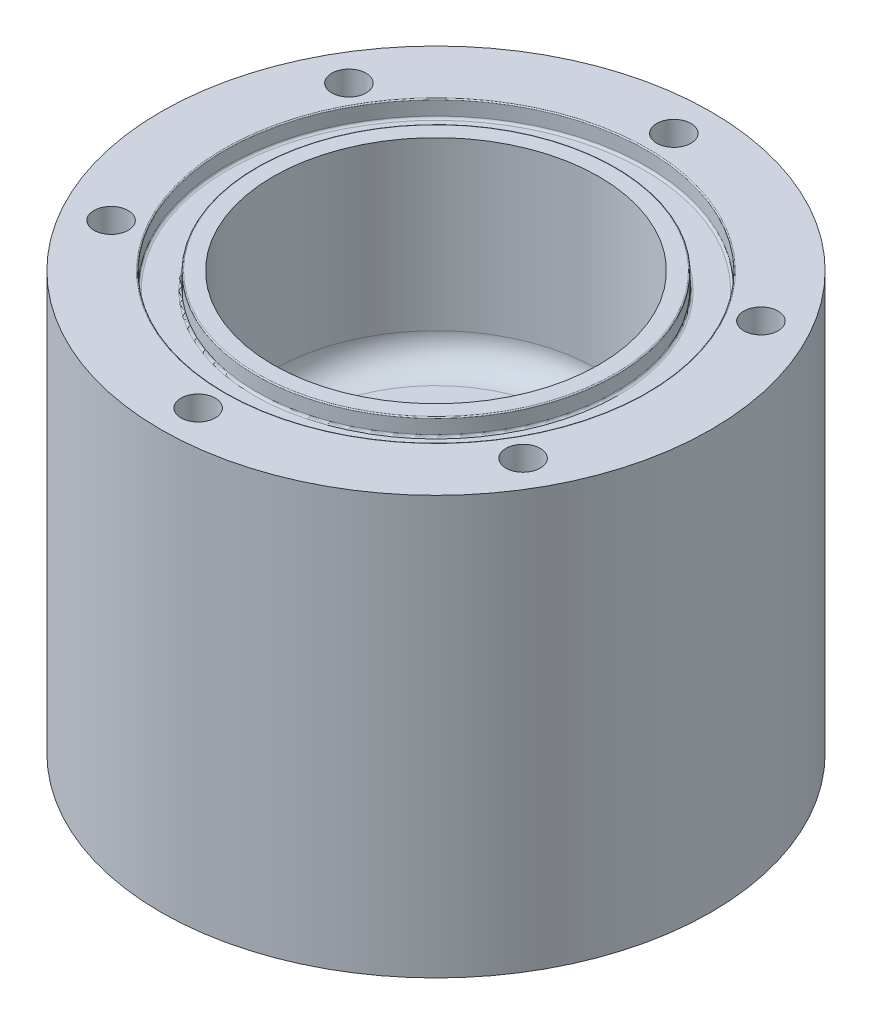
ISO-10303-21;
HEADER;
FILE_DESCRIPTION(('STEP AP214'),'2;1');
FILE_NAME('part.step','',(''),(''),'','','');
FILE_SCHEMA(('AUTOMOTIVE_DESIGN { 1 0 10303 214 1 1 1 1 }'));
ENDSEC;
DATA;
#1=APPLICATION_CONTEXT('core data for automotive mechanical design processes');
#2=APPLICATION_PROTOCOL_DEFINITION('international standard','automotive_design',2000,#1);
#3=PRODUCT_CONTEXT('',#1,'mechanical');
#4=PRODUCT('Part','Part','',(#3));
#5=PRODUCT_RELATED_PRODUCT_CATEGORY('part','',(#4));
#6=PRODUCT_DEFINITION_FORMATION('','',#4);
#7=PRODUCT_DEFINITION_CONTEXT('part definition',#1,'design');
#8=PRODUCT_DEFINITION('design','',#6,#7);
#9=PRODUCT_DEFINITION_SHAPE('','',#8);
#10=(LENGTH_UNIT() NAMED_UNIT(*) SI_UNIT(.MILLI.,.METRE.));
#11=(NAMED_UNIT(*) PLANE_ANGLE_UNIT() SI_UNIT($,.RADIAN.));
#12=(NAMED_UNIT(*) SI_UNIT($,.STERADIAN.) SOLID_ANGLE_UNIT());
#13=UNCERTAINTY_MEASURE_WITH_UNIT(LENGTH_MEASURE(1.E-05),#10,'distance_accuracy_value','');
#14=(GEOMETRIC_REPRESENTATION_CONTEXT(3) GLOBAL_UNCERTAINTY_ASSIGNED_CONTEXT((#13)) GLOBAL_UNIT_ASSIGNED_CONTEXT((#10,
#11,#12)) REPRESENTATION_CONTEXT('',''));
#15=CARTESIAN_POINT('',(0.,0.,0.));
#16=DIRECTION('',(0.,0.,1.));
#17=DIRECTION('',(1.,0.,0.));
#18=AXIS2_PLACEMENT_3D('',#15,#16,#17);
#19=CARTESIAN_POINT('',(11.1125000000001,9.52500000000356,0.));
#20=DIRECTION('',(0.,1.,0.));
#21=DIRECTION('',(0.,0.,1.));
#22=AXIS2_PLACEMENT_3D('',#19,#20,#21);
#23=PLANE('',#22);
#24=CARTESIAN_POINT('',(23.4708472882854,9.52500000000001,13.5509000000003));
#25=DIRECTION('',(0.,1.,0.));
#26=DIRECTION('',(0.866025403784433,0.,0.50000000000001));
#27=AXIS2_PLACEMENT_3D('',#24,#25,#26);
#28=CIRCLE('',#27,1.9558);
#29=CARTESIAN_POINT('',(25.164619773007,9.52500000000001,14.5288000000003));
#30=VERTEX_POINT('',#29);
#31=EDGE_CURVE('E255',#30,#30,#28,.T.);
#32=ORIENTED_EDGE('',*,*,#31,.T.);
#33=EDGE_LOOP('',(#32));
#34=FACE_BOUND('',#33,.T.);
#35=CARTESIAN_POINT('',(23.4708472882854,9.52499999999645,-13.5508999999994));
#36=DIRECTION('',(0.,1.,0.));
#37=DIRECTION('',(0.866025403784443,0.,-0.499999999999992));
#38=AXIS2_PLACEMENT_3D('',#35,#36,#37);
#39=CIRCLE('',#38,1.9558);
#40=CARTESIAN_POINT('',(25.164619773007,9.52499999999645,-14.5287999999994));
#41=VERTEX_POINT('',#40);
#42=EDGE_CURVE('E265',#41,#41,#39,.T.);
#43=ORIENTED_EDGE('',*,*,#42,.T.);
#44=EDGE_LOOP('',(#43));
#45=FACE_BOUND('',#44,.T.);
#46=CARTESIAN_POINT('',(0.,9.52500000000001,-27.1018000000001));
#47=DIRECTION('',(0.,1.,0.));
#48=DIRECTION('',(0.,0.,-1.));
#49=AXIS2_PLACEMENT_3D('',#46,#47,#48);
#50=CIRCLE('',#49,1.9558);
#51=CARTESIAN_POINT('',(0.,9.52500000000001,-29.0576000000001));
#52=VERTEX_POINT('',#51);
#53=EDGE_CURVE('E271',#52,#52,#50,.T.);
#54=ORIENTED_EDGE('',*,*,#53,.T.);
#55=EDGE_LOOP('',(#54));
#56=FACE_BOUND('',#55,.T.);
#57=CARTESIAN_POINT('',(-23.4708472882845,9.52500000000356,-13.5508999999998));
#58=DIRECTION('',(0.,1.,0.));
#59=DIRECTION('',(-0.866025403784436,0.,-0.500000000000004));
#60=AXIS2_PLACEMENT_3D('',#57,#58,#59);
#61=CIRCLE('',#60,1.9558);
#62=CARTESIAN_POINT('',(-25.1646197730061,9.52500000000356,-14.5287999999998));
#63=VERTEX_POINT('',#62);
#64=EDGE_CURVE('E277',#63,#63,#61,.T.);
#65=ORIENTED_EDGE('',*,*,#64,.T.);
#66=EDGE_LOOP('',(#65));
#67=FACE_BOUND('',#66,.T.);
#68=CARTESIAN_POINT('',(-23.4708472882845,9.52500000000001,13.5509000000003));
#69=DIRECTION('',(0.,1.,0.));
#70=DIRECTION('',(-0.86602540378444,0.,0.499999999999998));
#71=AXIS2_PLACEMENT_3D('',#68,#69,#70);
#72=CIRCLE('',#71,1.9558);
#73=CARTESIAN_POINT('',(-25.1646197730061,9.52500000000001,14.5288000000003));
#74=VERTEX_POINT('',#73);
#75=EDGE_CURVE('E283',#74,#74,#72,.T.);
#76=ORIENTED_EDGE('',*,*,#75,.T.);
#77=EDGE_LOOP('',(#76));
#78=FACE_BOUND('',#77,.T.);
#79=CARTESIAN_POINT('',(2.22044604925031E-13,9.52500000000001,27.1018000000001));
#80=DIRECTION('',(0.,1.,0.));
#81=DIRECTION('',(0.,0.,1.));
#82=AXIS2_PLACEMENT_3D('',#79,#80,#81);
#83=CIRCLE('',#82,1.9558);
#84=CARTESIAN_POINT('',(2.21936036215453E-13,9.52500000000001,29.0576000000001));
#85=VERTEX_POINT('',#84);
#86=EDGE_CURVE('E288',#85,#85,#83,.T.);
#87=ORIENTED_EDGE('',*,*,#86,.T.);
#88=EDGE_LOOP('',(#87));
#89=FACE_BOUND('',#88,.T.);
#90=CARTESIAN_POINT('',(0.,9.52500000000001,0.));
#91=DIRECTION('',(0.,1.,0.));
#92=DIRECTION('',(0.,0.,1.));
#93=AXIS2_PLACEMENT_3D('',#90,#91,#92);
#94=CIRCLE('',#93,31.353125);
#95=CARTESIAN_POINT('',(0.,9.52500000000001,31.353125));
#96=VERTEX_POINT('',#95);
#97=EDGE_CURVE('E10',#96,#96,#94,.T.);
#98=ORIENTED_EDGE('',*,*,#97,.F.);
#99=EDGE_LOOP('',(#98));
#100=FACE_BOUND('',#99,.T.);
#101=CARTESIAN_POINT('',(0.,9.52500000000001,0.));
#102=DIRECTION('',(0.,1.,0.));
#103=DIRECTION('',(0.,0.,1.));
#104=AXIS2_PLACEMENT_3D('',#101,#102,#103);
#105=CIRCLE('',#104,11.1125);
#106=CARTESIAN_POINT('',(0.,9.52500000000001,11.1125));
#107=VERTEX_POINT('',#106);
#108=EDGE_CURVE('E55',#107,#107,#105,.T.);
#109=ORIENTED_EDGE('',*,*,#108,.T.);
#110=EDGE_LOOP('',(#109));
#111=FACE_BOUND('',#110,.T.);
#112=ADVANCED_FACE('F36',(#34,#45,#56,#67,#78,#89,#100,#111),#23,.F.);
#113=CARTESIAN_POINT('',(0.,71.4865979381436,4.44089209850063E-13));
#114=DIRECTION('',(0.,1.,0.));
#115=DIRECTION('',(0.,0.,1.));
#116=AXIS2_PLACEMENT_3D('',#113,#114,#115);
#117=CYLINDRICAL_SURFACE('',#116,31.353125);
#118=CARTESIAN_POINT('',(2.22044604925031E-13,57.1500000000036,0.));
#119=DIRECTION('',(0.,1.,0.));
#120=DIRECTION('',(0.,0.,1.));
#121=AXIS2_PLACEMENT_3D('',#118,#119,#120);
#122=CIRCLE('',#121,31.353125);
#123=CARTESIAN_POINT('',(2.20304156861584E-13,57.1500000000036,31.353125));
#124=VERTEX_POINT('',#123);
#125=EDGE_CURVE('E43',#124,#124,#122,.T.);
#126=ORIENTED_EDGE('',*,*,#125,.F.);
#127=EDGE_LOOP('',(#126));
#128=FACE_BOUND('',#127,.T.);
#129=ORIENTED_EDGE('',*,*,#97,.T.);
#130=EDGE_LOOP('',(#129));
#131=FACE_BOUND('',#130,.T.);
#132=ADVANCED_FACE('F138',(#128,#131),#117,.T.);
#133=CARTESIAN_POINT('',(31.3531250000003,57.15,0.));
#134=DIRECTION('',(0.,-1.,0.));
#135=DIRECTION('',(0.,0.,-1.));
#136=AXIS2_PLACEMENT_3D('',#133,#134,#135);
#137=PLANE('',#136);
#138=CARTESIAN_POINT('',(23.4708472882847,57.15,13.5509000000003));
#139=DIRECTION('',(0.,1.,0.));
#140=DIRECTION('',(0.866025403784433,0.,0.50000000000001));
#141=AXIS2_PLACEMENT_3D('',#138,#139,#140);
#142=CIRCLE('',#141,1.9558);
#143=CARTESIAN_POINT('',(25.1646197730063,57.15,14.5288000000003));
#144=VERTEX_POINT('',#143);
#145=EDGE_CURVE('E258',#144,#144,#142,.T.);
#146=ORIENTED_EDGE('',*,*,#145,.F.);
#147=EDGE_LOOP('',(#146));
#148=FACE_BOUND('',#147,.T.);
#149=CARTESIAN_POINT('',(23.4708472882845,57.15,-13.5508999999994));
#150=DIRECTION('',(0.,1.,0.));
#151=DIRECTION('',(0.866025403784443,0.,-0.499999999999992));
#152=AXIS2_PLACEMENT_3D('',#149,#150,#151);
#153=CIRCLE('',#152,1.9558);
#154=CARTESIAN_POINT('',(25.1646197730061,57.15,-14.5287999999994));
#155=VERTEX_POINT('',#154);
#156=EDGE_CURVE('E260',#155,#155,#153,.T.);
#157=ORIENTED_EDGE('',*,*,#156,.F.);
#158=EDGE_LOOP('',(#157));
#159=FACE_BOUND('',#158,.T.);
#160=CARTESIAN_POINT('',(2.22044604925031E-13,57.15,-27.1018000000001));
#161=DIRECTION('',(0.,1.,0.));
#162=DIRECTION('',(0.,0.,-1.));
#163=AXIS2_PLACEMENT_3D('',#160,#161,#162);
#164=CIRCLE('',#163,1.9558);
#165=CARTESIAN_POINT('',(2.35887115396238E-13,57.15,-29.0576000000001));
#166=VERTEX_POINT('',#165);
#167=EDGE_CURVE('E268',#166,#166,#164,.T.);
#168=ORIENTED_EDGE('',*,*,#167,.F.);
#169=EDGE_LOOP('',(#168));
#170=FACE_BOUND('',#169,.T.);
#171=CARTESIAN_POINT('',(-23.4708472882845,57.15,-13.5509000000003));
#172=DIRECTION('',(0.,1.,0.));
#173=DIRECTION('',(-0.866025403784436,0.,-0.500000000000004));
#174=AXIS2_PLACEMENT_3D('',#171,#172,#173);
#175=CIRCLE('',#174,1.9558);
#176=CARTESIAN_POINT('',(-25.1646197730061,57.15,-14.5288000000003));
#177=VERTEX_POINT('',#176);
#178=EDGE_CURVE('E274',#177,#177,#175,.T.);
#179=ORIENTED_EDGE('',*,*,#178,.F.);
#180=EDGE_LOOP('',(#179));
#181=FACE_BOUND('',#180,.T.);
#182=CARTESIAN_POINT('',(-23.4708472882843,57.15,13.5509000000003));
#183=DIRECTION('',(0.,1.,0.));
#184=DIRECTION('',(-0.86602540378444,0.,0.499999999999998));
#185=AXIS2_PLACEMENT_3D('',#182,#183,#184);
#186=CIRCLE('',#185,1.9558);
#187=CARTESIAN_POINT('',(-25.1646197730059,57.15,14.5288000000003));
#188=VERTEX_POINT('',#187);
#189=EDGE_CURVE('E280',#188,#188,#186,.T.);
#190=ORIENTED_EDGE('',*,*,#189,.F.);
#191=EDGE_LOOP('',(#190));
#192=FACE_BOUND('',#191,.T.);
#193=CARTESIAN_POINT('',(2.22044604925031E-13,57.15,27.1018000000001));
#194=DIRECTION('',(0.,1.,0.));
#195=DIRECTION('',(0.,0.,1.));
#196=AXIS2_PLACEMENT_3D('',#193,#194,#195);
#197=CIRCLE('',#196,1.9558);
#198=CARTESIAN_POINT('',(2.21936036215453E-13,57.15,29.0576000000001));
#199=VERTEX_POINT('',#198);
#200=EDGE_CURVE('E286',#199,#199,#197,.T.);
#201=ORIENTED_EDGE('',*,*,#200,.F.);
#202=EDGE_LOOP('',(#201));
#203=FACE_BOUND('',#202,.T.);
#204=CARTESIAN_POINT('',(2.22044604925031E-13,57.1500000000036,0.));
#205=DIRECTION('',(0.,1.,0.));
#206=DIRECTION('',(0.,0.,1.));
#207=AXIS2_PLACEMENT_3D('',#204,#205,#206);
#208=CIRCLE('',#207,24.13);
#209=CARTESIAN_POINT('',(2.20705120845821E-13,57.1500000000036,24.13));
#210=VERTEX_POINT('',#209);
#211=EDGE_CURVE('E48',#210,#210,#208,.T.);
#212=ORIENTED_EDGE('',*,*,#211,.F.);
#213=EDGE_LOOP('',(#212));
#214=FACE_BOUND('',#213,.T.);
#215=ORIENTED_EDGE('',*,*,#125,.T.);
#216=EDGE_LOOP('',(#215));
#217=FACE_BOUND('',#216,.T.);
#218=ADVANCED_FACE('F135',(#148,#159,#170,#181,#192,#203,#214,#217),#137,.F.);
#219=CARTESIAN_POINT('',(2.22044604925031E-13,57.0229999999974,0.));
#220=DIRECTION('',(0.,1.,0.));
#221=DIRECTION('',(0.,0.,1.));
#222=AXIS2_PLACEMENT_3D('',#219,#220,#221);
#223=TOROIDAL_SURFACE('',#222,24.13,0.127);
#224=CARTESIAN_POINT('',(2.22044604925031E-13,57.0229999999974,0.));
#225=DIRECTION('',(0.,1.,0.));
#226=DIRECTION('',(0.,0.,1.));
#227=AXIS2_PLACEMENT_3D('',#224,#225,#226);
#228=CIRCLE('',#227,24.003);
#229=CARTESIAN_POINT('',(2.20712170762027E-13,57.0229999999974,24.003));
#230=VERTEX_POINT('',#229);
#231=EDGE_CURVE('E128',#230,#230,#228,.T.);
#232=ORIENTED_EDGE('',*,*,#231,.F.);
#233=EDGE_LOOP('',(#232));
#234=FACE_BOUND('',#233,.T.);
#235=ORIENTED_EDGE('',*,*,#211,.T.);
#236=EDGE_LOOP('',(#235));
#237=FACE_BOUND('',#236,.T.);
#238=ADVANCED_FACE('F133',(#234,#237),#223,.T.);
#239=CARTESIAN_POINT('',(0.,71.4865979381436,4.44089209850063E-13));
#240=DIRECTION('',(0.,1.,0.));
#241=DIRECTION('',(0.,0.,1.));
#242=AXIS2_PLACEMENT_3D('',#239,#240,#241);
#243=CYLINDRICAL_SURFACE('',#242,24.003);
#244=CARTESIAN_POINT('',(-6.66133814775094E-13,55.4482000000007,0.));
#245=DIRECTION('',(0.,1.,0.));
#246=DIRECTION('',(0.,0.,1.));
#247=AXIS2_PLACEMENT_3D('',#244,#245,#246);
#248=CIRCLE('',#247,24.003);
#249=CARTESIAN_POINT('',(-6.67466248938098E-13,55.4482000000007,24.003));
#250=VERTEX_POINT('',#249);
#251=EDGE_CURVE('E125',#250,#250,#248,.T.);
#252=ORIENTED_EDGE('',*,*,#251,.F.);
#253=EDGE_LOOP('',(#252));
#254=FACE_BOUND('',#253,.T.);
#255=ORIENTED_EDGE('',*,*,#231,.T.);
#256=EDGE_LOOP('',(#255));
#257=FACE_BOUND('',#256,.T.);
#258=ADVANCED_FACE('F151',(#254,#257),#243,.F.);
#259=CARTESIAN_POINT('',(-6.66133814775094E-13,55.4482000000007,0.));
#260=DIRECTION('',(0.,1.,0.));
#261=DIRECTION('',(0.,0.,1.));
#262=AXIS2_PLACEMENT_3D('',#259,#260,#261);
#263=TOROIDAL_SURFACE('',#262,23.749,0.253999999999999);
#264=CARTESIAN_POINT('',(1.11022302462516E-12,55.1942000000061,0.));
#265=DIRECTION('',(0.,1.,0.));
#266=DIRECTION('',(0.,0.,1.));
#267=AXIS2_PLACEMENT_3D('',#264,#265,#266);
#268=CIRCLE('',#267,23.749);
#269=CARTESIAN_POINT('',(1.10890469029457E-12,55.1942000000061,23.749));
#270=VERTEX_POINT('',#269);
#271=EDGE_CURVE('E122',#270,#270,#268,.T.);
#272=ORIENTED_EDGE('',*,*,#271,.F.);
#273=EDGE_LOOP('',(#272));
#274=FACE_BOUND('',#273,.T.);
#275=ORIENTED_EDGE('',*,*,#251,.T.);
#276=EDGE_LOOP('',(#275));
#277=FACE_BOUND('',#276,.T.);
#278=ADVANCED_FACE('F155',(#274,#277),#263,.F.);
#279=CARTESIAN_POINT('',(20.7264,55.1942000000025,0.));
#280=DIRECTION('',(0.,-1.,0.));
#281=DIRECTION('',(0.,0.,-1.));
#282=AXIS2_PLACEMENT_3D('',#279,#280,#281);
#283=PLANE('',#282);
#284=CARTESIAN_POINT('',(1.11022302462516E-12,55.1942000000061,0.));
#285=DIRECTION('',(0.,1.,0.));
#286=DIRECTION('',(0.,0.,1.));
#287=AXIS2_PLACEMENT_3D('',#284,#285,#286);
#288=CIRCLE('',#287,20.7264);
#289=CARTESIAN_POINT('',(1.10907247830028E-12,55.1942000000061,20.7264));
#290=VERTEX_POINT('',#289);
#291=EDGE_CURVE('E119',#290,#290,#288,.T.);
#292=ORIENTED_EDGE('',*,*,#291,.F.);
#293=EDGE_LOOP('',(#292));
#294=FACE_BOUND('',#293,.T.);
#295=ORIENTED_EDGE('',*,*,#271,.T.);
#296=EDGE_LOOP('',(#295));
#297=FACE_BOUND('',#296,.T.);
#298=ADVANCED_FACE('F159',(#294,#297),#283,.F.);
#299=CARTESIAN_POINT('',(-6.66133814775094E-13,55.4482000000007,0.));
#300=DIRECTION('',(0.,1.,0.));
#301=DIRECTION('',(0.,0.,1.));
#302=AXIS2_PLACEMENT_3D('',#299,#300,#301);
#303=TOROIDAL_SURFACE('',#302,20.7264,0.253999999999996);
#304=CARTESIAN_POINT('',(-6.66133814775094E-13,55.4482000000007,0.));
#305=DIRECTION('',(0.,1.,0.));
#306=DIRECTION('',(0.,0.,1.));
#307=AXIS2_PLACEMENT_3D('',#304,#305,#306);
#308=CIRCLE('',#307,20.4724);
#309=CARTESIAN_POINT('',(-6.67270261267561E-13,55.4482000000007,20.4724));
#310=VERTEX_POINT('',#309);
#311=EDGE_CURVE('E116',#310,#310,#308,.T.);
#312=ORIENTED_EDGE('',*,*,#311,.F.);
#313=EDGE_LOOP('',(#312));
#314=FACE_BOUND('',#313,.T.);
#315=ORIENTED_EDGE('',*,*,#291,.T.);
#316=EDGE_LOOP('',(#315));
#317=FACE_BOUND('',#316,.T.);
#318=ADVANCED_FACE('F163',(#314,#317),#303,.F.);
#319=CARTESIAN_POINT('',(0.,71.4865979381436,4.44089209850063E-13));
#320=DIRECTION('',(0.,1.,0.));
#321=DIRECTION('',(0.,0.,1.));
#322=AXIS2_PLACEMENT_3D('',#319,#320,#321);
#323=CYLINDRICAL_SURFACE('',#322,20.4724);
#324=CARTESIAN_POINT('',(2.22044604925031E-13,57.0229999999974,0.));
#325=DIRECTION('',(0.,1.,0.));
#326=DIRECTION('',(0.,0.,1.));
#327=AXIS2_PLACEMENT_3D('',#324,#325,#326);
#328=CIRCLE('',#327,20.4724);
#329=CARTESIAN_POINT('',(2.20908158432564E-13,57.0229999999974,20.4724));
#330=VERTEX_POINT('',#329);
#331=EDGE_CURVE('E113',#330,#330,#328,.T.);
#332=ORIENTED_EDGE('',*,*,#331,.F.);
#333=EDGE_LOOP('',(#332));
#334=FACE_BOUND('',#333,.T.);
#335=ORIENTED_EDGE('',*,*,#311,.T.);
#336=EDGE_LOOP('',(#335));
#337=FACE_BOUND('',#336,.T.);
#338=ADVANCED_FACE('F167',(#334,#337),#323,.T.);
#339=CARTESIAN_POINT('',(2.22044604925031E-13,57.0229999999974,0.));
#340=DIRECTION('',(0.,1.,0.));
#341=DIRECTION('',(0.,0.,1.));
#342=AXIS2_PLACEMENT_3D('',#339,#340,#341);
#343=TOROIDAL_SURFACE('',#342,20.3454,0.127000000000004);
#344=CARTESIAN_POINT('',(2.22044604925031E-13,57.1500000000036,0.));
#345=DIRECTION('',(0.,1.,0.));
#346=DIRECTION('',(0.,0.,1.));
#347=AXIS2_PLACEMENT_3D('',#344,#345,#346);
#348=CIRCLE('',#347,20.3454);
#349=CARTESIAN_POINT('',(2.20915208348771E-13,57.1500000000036,20.3454));
#350=VERTEX_POINT('',#349);
#351=EDGE_CURVE('E110',#350,#350,#348,.T.);
#352=ORIENTED_EDGE('',*,*,#351,.F.);
#353=EDGE_LOOP('',(#352));
#354=FACE_BOUND('',#353,.T.);
#355=ORIENTED_EDGE('',*,*,#331,.T.);
#356=EDGE_LOOP('',(#355));
#357=FACE_BOUND('',#356,.T.);
#358=ADVANCED_FACE('F171',(#354,#357),#343,.T.);
#359=CARTESIAN_POINT('',(20.3454000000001,57.1499999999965,-4.44089209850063E-13));
#360=DIRECTION('',(0.,-1.,0.));
#361=DIRECTION('',(0.,0.,-1.));
#362=AXIS2_PLACEMENT_3D('',#359,#360,#361);
#363=PLANE('',#362);
#364=CARTESIAN_POINT('',(2.22044604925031E-13,57.1500000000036,0.));
#365=DIRECTION('',(0.,1.,0.));
#366=DIRECTION('',(0.,0.,1.));
#367=AXIS2_PLACEMENT_3D('',#364,#365,#366);
#368=CIRCLE('',#367,18.5674);
#369=CARTESIAN_POINT('',(2.2101390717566E-13,57.1500000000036,18.5674));
#370=VERTEX_POINT('',#369);
#371=EDGE_CURVE('E107',#370,#370,#368,.T.);
#372=ORIENTED_EDGE('',*,*,#371,.F.);
#373=EDGE_LOOP('',(#372));
#374=FACE_BOUND('',#373,.T.);
#375=ORIENTED_EDGE('',*,*,#351,.T.);
#376=EDGE_LOOP('',(#375));
#377=FACE_BOUND('',#376,.T.);
#378=ADVANCED_FACE('F175',(#374,#377),#363,.F.);
#379=CARTESIAN_POINT('',(0.,71.4865979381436,4.44089209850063E-13));
#380=DIRECTION('',(0.,1.,0.));
#381=DIRECTION('',(0.,0.,1.));
#382=AXIS2_PLACEMENT_3D('',#379,#380,#381);
#383=CYLINDRICAL_SURFACE('',#382,18.5674);
#384=CARTESIAN_POINT('',(0.,38.1000000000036,0.));
#385=DIRECTION('',(0.,1.,0.));
#386=DIRECTION('',(0.,0.,1.));
#387=AXIS2_PLACEMENT_3D('',#384,#385,#386);
#388=CIRCLE('',#387,18.5674);
#389=CARTESIAN_POINT('',(0.,38.1000000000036,18.5674));
#390=VERTEX_POINT('',#389);
#391=EDGE_CURVE('E104',#390,#390,#388,.T.);
#392=ORIENTED_EDGE('',*,*,#391,.F.);
#393=EDGE_LOOP('',(#392));
#394=FACE_BOUND('',#393,.T.);
#395=ORIENTED_EDGE('',*,*,#371,.T.);
#396=EDGE_LOOP('',(#395));
#397=FACE_BOUND('',#396,.T.);
#398=ADVANCED_FACE('F179',(#394,#397),#383,.F.);
#399=CARTESIAN_POINT('',(0.,38.1000000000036,0.));
#400=DIRECTION('',(0.,1.,0.));
#401=DIRECTION('',(0.,0.,1.));
#402=AXIS2_PLACEMENT_3D('',#399,#400,#401);
#403=TOROIDAL_SURFACE('',#402,15.3924,3.175);
#404=CARTESIAN_POINT('',(0.,34.9250000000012,0.));
#405=DIRECTION('',(0.,1.,0.));
#406=DIRECTION('',(0.,0.,1.));
#407=AXIS2_PLACEMENT_3D('',#404,#405,#406);
#408=CIRCLE('',#407,15.3924);
#409=CARTESIAN_POINT('',(0.,34.9250000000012,15.3924));
#410=VERTEX_POINT('',#409);
#411=EDGE_CURVE('E101',#410,#410,#408,.T.);
#412=ORIENTED_EDGE('',*,*,#411,.F.);
#413=EDGE_LOOP('',(#412));
#414=FACE_BOUND('',#413,.T.);
#415=ORIENTED_EDGE('',*,*,#391,.T.);
#416=EDGE_LOOP('',(#415));
#417=FACE_BOUND('',#416,.T.);
#418=ADVANCED_FACE('F183',(#414,#417),#403,.F.);
#419=CARTESIAN_POINT('',(15.3923999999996,34.9250000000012,0.));
#420=DIRECTION('',(0.,-1.,0.));
#421=DIRECTION('',(0.,0.,-1.));
#422=AXIS2_PLACEMENT_3D('',#419,#420,#421);
#423=PLANE('',#422);
#424=CARTESIAN_POINT('',(6.87407664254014,34.9249999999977,3.96874999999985));
#425=DIRECTION('',(0.,1.,0.));
#426=DIRECTION('',(0.866025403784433,0.,0.50000000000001));
#427=AXIS2_PLACEMENT_3D('',#424,#425,#426);
#428=CIRCLE('',#427,0.9652);
#429=CARTESIAN_POINT('',(7.70996436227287,34.9249999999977,4.45134999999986));
#430=VERTEX_POINT('',#429);
#431=EDGE_CURVE('E84',#430,#430,#428,.T.);
#432=ORIENTED_EDGE('',*,*,#431,.F.);
#433=EDGE_LOOP('',(#432));
#434=FACE_BOUND('',#433,.T.);
#435=CARTESIAN_POINT('',(6.87407664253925,34.9250000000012,-3.96874999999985));
#436=DIRECTION('',(0.,1.,0.));
#437=DIRECTION('',(0.866025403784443,0.,-0.499999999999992));
#438=AXIS2_PLACEMENT_3D('',#435,#436,#437);
#439=CIRCLE('',#438,0.9652);
#440=CARTESIAN_POINT('',(7.70996436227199,34.9250000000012,-4.45134999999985));
#441=VERTEX_POINT('',#440);
#442=EDGE_CURVE('E74',#441,#441,#439,.T.);
#443=ORIENTED_EDGE('',*,*,#442,.F.);
#444=EDGE_LOOP('',(#443));
#445=FACE_BOUND('',#444,.T.);
#446=CARTESIAN_POINT('',(8.88178419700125E-13,34.9250000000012,-7.93750000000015));
#447=DIRECTION('',(0.,1.,0.));
#448=DIRECTION('',(0.,0.,-1.));
#449=AXIS2_PLACEMENT_3D('',#446,#447,#448);
#450=CIRCLE('',#449,0.9652);
#451=CARTESIAN_POINT('',(8.95009788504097E-13,34.9250000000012,-8.90270000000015));
#452=VERTEX_POINT('',#451);
#453=EDGE_CURVE('E71',#452,#452,#450,.T.);
#454=ORIENTED_EDGE('',*,*,#453,.F.);
#455=EDGE_LOOP('',(#454));
#456=FACE_BOUND('',#455,.T.);
#457=CARTESIAN_POINT('',(-6.87407664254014,34.9250000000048,-3.9687500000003));
#458=DIRECTION('',(0.,1.,0.));
#459=DIRECTION('',(-0.866025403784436,0.,-0.500000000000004));
#460=AXIS2_PLACEMENT_3D('',#457,#458,#459);
#461=CIRCLE('',#460,0.9652);
#462=CARTESIAN_POINT('',(-7.70996436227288,34.9250000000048,-4.4513500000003));
#463=VERTEX_POINT('',#462);
#464=EDGE_CURVE('E68',#463,#463,#461,.T.);
#465=ORIENTED_EDGE('',*,*,#464,.F.);
#466=EDGE_LOOP('',(#465));
#467=FACE_BOUND('',#466,.T.);
#468=CARTESIAN_POINT('',(-6.87407664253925,34.9250000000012,3.96874999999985));
#469=DIRECTION('',(0.,1.,0.));
#470=DIRECTION('',(-0.86602540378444,0.,0.499999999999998));
#471=AXIS2_PLACEMENT_3D('',#468,#469,#470);
#472=CIRCLE('',#471,0.9652);
#473=CARTESIAN_POINT('',(-7.70996436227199,34.9250000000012,4.45134999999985));
#474=VERTEX_POINT('',#473);
#475=EDGE_CURVE('E64',#474,#474,#472,.T.);
#476=ORIENTED_EDGE('',*,*,#475,.F.);
#477=EDGE_LOOP('',(#476));
#478=FACE_BOUND('',#477,.T.);
#479=CARTESIAN_POINT('',(0.,34.9250000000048,7.93750000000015));
#480=DIRECTION('',(0.,1.,0.));
#481=DIRECTION('',(0.,0.,1.));
#482=AXIS2_PLACEMENT_3D('',#479,#480,#481);
#483=CIRCLE('',#482,0.9652);
#484=CARTESIAN_POINT('',(0.,34.9250000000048,8.90270000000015));
#485=VERTEX_POINT('',#484);
#486=EDGE_CURVE('E60',#485,#485,#483,.T.);
#487=ORIENTED_EDGE('',*,*,#486,.F.);
#488=EDGE_LOOP('',(#487));
#489=FACE_BOUND('',#488,.T.);
#490=CARTESIAN_POINT('',(0.,34.9250000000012,0.));
#491=DIRECTION('',(0.,1.,0.));
#492=DIRECTION('',(0.,0.,1.));
#493=AXIS2_PLACEMENT_3D('',#490,#491,#492);
#494=CIRCLE('',#493,0.9652);
#495=CARTESIAN_POINT('',(0.,34.9250000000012,0.9652));
#496=VERTEX_POINT('',#495);
#497=EDGE_CURVE('E56',#496,#496,#494,.T.);
#498=ORIENTED_EDGE('',*,*,#497,.F.);
#499=EDGE_LOOP('',(#498));
#500=FACE_BOUND('',#499,.T.);
#501=ORIENTED_EDGE('',*,*,#411,.T.);
#502=EDGE_LOOP('',(#501));
#503=FACE_BOUND('',#502,.T.);
#504=ADVANCED_FACE('F187',(#434,#445,#456,#467,#478,#489,#500,#503),#423,.F.);
#505=CARTESIAN_POINT('',(11.1125000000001,28.575,4.44089209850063E-13));
#506=DIRECTION('',(0.,1.,0.));
#507=DIRECTION('',(0.,0.,1.));
#508=AXIS2_PLACEMENT_3D('',#505,#506,#507);
#509=PLANE('',#508);
#510=CARTESIAN_POINT('',(6.87407664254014,28.5749999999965,3.96874999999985));
#511=DIRECTION('',(0.,1.,0.));
#512=DIRECTION('',(0.,0.,1.));
#513=AXIS2_PLACEMENT_3D('',#510,#511,#512);
#514=CIRCLE('',#513,0.9652);
#515=CARTESIAN_POINT('',(6.87407664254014,28.5749999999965,4.93394999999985));
#516=VERTEX_POINT('',#515);
#517=EDGE_CURVE('E39',#516,#516,#514,.T.);
#518=ORIENTED_EDGE('',*,*,#517,.T.);
#519=EDGE_LOOP('',(#518));
#520=FACE_BOUND('',#519,.T.);
#521=CARTESIAN_POINT('',(6.87407664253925,28.575,-3.96874999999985));
#522=DIRECTION('',(0.,1.,0.));
#523=DIRECTION('',(0.,0.,1.));
#524=AXIS2_PLACEMENT_3D('',#521,#522,#523);
#525=CIRCLE('',#524,0.9652);
#526=CARTESIAN_POINT('',(6.87407664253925,28.575,-3.00354999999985));
#527=VERTEX_POINT('',#526);
#528=EDGE_CURVE('E72',#527,#527,#525,.T.);
#529=ORIENTED_EDGE('',*,*,#528,.T.);
#530=EDGE_LOOP('',(#529));
#531=FACE_BOUND('',#530,.T.);
#532=CARTESIAN_POINT('',(-2.22044604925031E-13,28.575,-7.93749999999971));
#533=DIRECTION('',(0.,1.,0.));
#534=DIRECTION('',(0.,0.,1.));
#535=AXIS2_PLACEMENT_3D('',#532,#533,#534);
#536=CIRCLE('',#535,0.9652);
#537=CARTESIAN_POINT('',(-2.220981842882E-13,28.575,-6.97229999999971));
#538=VERTEX_POINT('',#537);
#539=EDGE_CURVE('E69',#538,#538,#536,.T.);
#540=ORIENTED_EDGE('',*,*,#539,.T.);
#541=EDGE_LOOP('',(#540));
#542=FACE_BOUND('',#541,.T.);
#543=CARTESIAN_POINT('',(-6.87407664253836,28.575,-3.96874999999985));
#544=DIRECTION('',(0.,1.,0.));
#545=DIRECTION('',(0.,0.,1.));
#546=AXIS2_PLACEMENT_3D('',#543,#544,#545);
#547=CIRCLE('',#546,0.9652);
#548=CARTESIAN_POINT('',(-6.87407664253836,28.575,-3.00354999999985));
#549=VERTEX_POINT('',#548);
#550=EDGE_CURVE('E65',#549,#549,#547,.T.);
#551=ORIENTED_EDGE('',*,*,#550,.T.);
#552=EDGE_LOOP('',(#551));
#553=FACE_BOUND('',#552,.T.);
#554=CARTESIAN_POINT('',(-6.87407664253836,28.575,3.96874999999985));
#555=DIRECTION('',(0.,1.,0.));
#556=DIRECTION('',(0.,0.,1.));
#557=AXIS2_PLACEMENT_3D('',#554,#555,#556);
#558=CIRCLE('',#557,0.9652);
#559=CARTESIAN_POINT('',(-6.87407664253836,28.575,4.93394999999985));
#560=VERTEX_POINT('',#559);
#561=EDGE_CURVE('E61',#560,#560,#558,.T.);
#562=ORIENTED_EDGE('',*,*,#561,.T.);
#563=EDGE_LOOP('',(#562));
#564=FACE_BOUND('',#563,.T.);
#565=CARTESIAN_POINT('',(0.,28.575,7.93750000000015));
#566=DIRECTION('',(0.,1.,0.));
#567=DIRECTION('',(0.,0.,1.));
#568=AXIS2_PLACEMENT_3D('',#565,#566,#567);
#569=CIRCLE('',#568,0.9652);
#570=CARTESIAN_POINT('',(0.,28.575,8.90270000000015));
#571=VERTEX_POINT('',#570);
#572=EDGE_CURVE('E57',#571,#571,#569,.T.);
#573=ORIENTED_EDGE('',*,*,#572,.T.);
#574=EDGE_LOOP('',(#573));
#575=FACE_BOUND('',#574,.T.);
#576=CARTESIAN_POINT('',(0.,28.575,0.));
#577=DIRECTION('',(0.,1.,0.));
#578=DIRECTION('',(0.,0.,1.));
#579=AXIS2_PLACEMENT_3D('',#576,#577,#578);
#580=CIRCLE('',#579,0.9652);
#581=CARTESIAN_POINT('',(0.,28.575,0.9652));
#582=VERTEX_POINT('',#581);
#583=EDGE_CURVE('E52',#582,#582,#580,.T.);
#584=ORIENTED_EDGE('',*,*,#583,.T.);
#585=EDGE_LOOP('',(#584));
#586=FACE_BOUND('',#585,.T.);
#587=CARTESIAN_POINT('',(0.,28.575,0.));
#588=DIRECTION('',(0.,1.,0.));
#589=DIRECTION('',(0.,0.,1.));
#590=AXIS2_PLACEMENT_3D('',#587,#588,#589);
#591=CIRCLE('',#590,11.1125);
#592=CARTESIAN_POINT('',(0.,28.575,11.1125));
#593=VERTEX_POINT('',#592);
#594=EDGE_CURVE('E98',#593,#593,#591,.T.);
#595=ORIENTED_EDGE('',*,*,#594,.F.);
#596=EDGE_LOOP('',(#595));
#597=FACE_BOUND('',#596,.T.);
#598=ADVANCED_FACE('F191',(#520,#531,#542,#553,#564,#575,#586,#597),#509,.F.);
#599=CARTESIAN_POINT('',(0.,71.4865979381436,4.44089209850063E-13));
#600=DIRECTION('',(0.,1.,0.));
#601=DIRECTION('',(0.,0.,1.));
#602=AXIS2_PLACEMENT_3D('',#599,#600,#601);
#603=CYLINDRICAL_SURFACE('',#602,11.1125);
#604=ORIENTED_EDGE('',*,*,#108,.F.);
#605=EDGE_LOOP('',(#604));
#606=FACE_BOUND('',#605,.T.);
#607=ORIENTED_EDGE('',*,*,#594,.T.);
#608=EDGE_LOOP('',(#607));
#609=FACE_BOUND('',#608,.T.);
#610=ADVANCED_FACE('F195',(#606,#609),#603,.F.);
#611=CARTESIAN_POINT('',(0.,9.52500000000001,0.));
#612=DIRECTION('',(0.,1.,0.));
#613=DIRECTION('',(0.,0.,1.));
#614=AXIS2_PLACEMENT_3D('',#611,#612,#613);
#615=CYLINDRICAL_SURFACE('',#614,0.9652);
#616=ORIENTED_EDGE('',*,*,#497,.T.);
#617=EDGE_LOOP('',(#616));
#618=FACE_BOUND('',#617,.T.);
#619=ORIENTED_EDGE('',*,*,#583,.F.);
#620=EDGE_LOOP('',(#619));
#621=FACE_BOUND('',#620,.T.);
#622=ADVANCED_FACE('F199',(#618,#621),#615,.F.);
#623=CARTESIAN_POINT('',(0.,9.52500000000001,7.93750000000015));
#624=DIRECTION('',(0.,1.,0.));
#625=DIRECTION('',(0.,0.,1.));
#626=AXIS2_PLACEMENT_3D('',#623,#624,#625);
#627=CYLINDRICAL_SURFACE('',#626,0.9652);
#628=ORIENTED_EDGE('',*,*,#486,.T.);
#629=EDGE_LOOP('',(#628));
#630=FACE_BOUND('',#629,.T.);
#631=ORIENTED_EDGE('',*,*,#572,.F.);
#632=EDGE_LOOP('',(#631));
#633=FACE_BOUND('',#632,.T.);
#634=ADVANCED_FACE('F203',(#630,#633),#627,.F.);
#635=CARTESIAN_POINT('',(-6.87407664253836,9.52500000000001,3.96874999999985));
#636=DIRECTION('',(0.,1.,0.));
#637=DIRECTION('',(0.,0.,1.));
#638=AXIS2_PLACEMENT_3D('',#635,#636,#637);
#639=CYLINDRICAL_SURFACE('',#638,0.9652);
#640=ORIENTED_EDGE('',*,*,#475,.T.);
#641=EDGE_LOOP('',(#640));
#642=FACE_BOUND('',#641,.T.);
#643=ORIENTED_EDGE('',*,*,#561,.F.);
#644=EDGE_LOOP('',(#643));
#645=FACE_BOUND('',#644,.T.);
#646=ADVANCED_FACE('F207',(#642,#645),#639,.F.);
#647=CARTESIAN_POINT('',(-6.87407664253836,9.52499999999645,-3.96874999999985));
#648=DIRECTION('',(0.,1.,0.));
#649=DIRECTION('',(0.,0.,1.));
#650=AXIS2_PLACEMENT_3D('',#647,#648,#649);
#651=CYLINDRICAL_SURFACE('',#650,0.9652);
#652=ORIENTED_EDGE('',*,*,#464,.T.);
#653=EDGE_LOOP('',(#652));
#654=FACE_BOUND('',#653,.T.);
#655=ORIENTED_EDGE('',*,*,#550,.F.);
#656=EDGE_LOOP('',(#655));
#657=FACE_BOUND('',#656,.T.);
#658=ADVANCED_FACE('F211',(#654,#657),#651,.F.);
#659=CARTESIAN_POINT('',(0.,9.52500000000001,-7.93749999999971));
#660=DIRECTION('',(0.,1.,0.));
#661=DIRECTION('',(0.,0.,1.));
#662=AXIS2_PLACEMENT_3D('',#659,#660,#661);
#663=CYLINDRICAL_SURFACE('',#662,0.9652);
#664=ORIENTED_EDGE('',*,*,#453,.T.);
#665=EDGE_LOOP('',(#664));
#666=FACE_BOUND('',#665,.T.);
#667=ORIENTED_EDGE('',*,*,#539,.F.);
#668=EDGE_LOOP('',(#667));
#669=FACE_BOUND('',#668,.T.);
#670=ADVANCED_FACE('F215',(#666,#669),#663,.F.);
#671=CARTESIAN_POINT('',(6.87407664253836,9.52500000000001,-3.96874999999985));
#672=DIRECTION('',(0.,1.,0.));
#673=DIRECTION('',(0.,0.,1.));
#674=AXIS2_PLACEMENT_3D('',#671,#672,#673);
#675=CYLINDRICAL_SURFACE('',#674,0.9652);
#676=ORIENTED_EDGE('',*,*,#442,.T.);
#677=EDGE_LOOP('',(#676));
#678=FACE_BOUND('',#677,.T.);
#679=ORIENTED_EDGE('',*,*,#528,.F.);
#680=EDGE_LOOP('',(#679));
#681=FACE_BOUND('',#680,.T.);
#682=ADVANCED_FACE('F219',(#678,#681),#675,.F.);
#683=CARTESIAN_POINT('',(6.87407664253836,9.52500000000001,3.9687500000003));
#684=DIRECTION('',(0.,1.,0.));
#685=DIRECTION('',(0.,0.,1.));
#686=AXIS2_PLACEMENT_3D('',#683,#684,#685);
#687=CYLINDRICAL_SURFACE('',#686,0.9652);
#688=ORIENTED_EDGE('',*,*,#431,.T.);
#689=EDGE_LOOP('',(#688));
#690=FACE_BOUND('',#689,.T.);
#691=ORIENTED_EDGE('',*,*,#517,.F.);
#692=EDGE_LOOP('',(#691));
#693=FACE_BOUND('',#692,.T.);
#694=ADVANCED_FACE('F223',(#690,#693),#687,.F.);
#695=CARTESIAN_POINT('',(2.22044604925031E-13,9.52500000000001,27.1018000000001));
#696=DIRECTION('',(0.,1.,0.));
#697=DIRECTION('',(0.,0.,1.));
#698=AXIS2_PLACEMENT_3D('',#695,#696,#697);
#699=CYLINDRICAL_SURFACE('',#698,1.9558);
#700=ORIENTED_EDGE('',*,*,#86,.F.);
#701=EDGE_LOOP('',(#700));
#702=FACE_BOUND('',#701,.T.);
#703=ORIENTED_EDGE('',*,*,#200,.T.);
#704=EDGE_LOOP('',(#703));
#705=FACE_BOUND('',#704,.T.);
#706=ADVANCED_FACE('F226',(#702,#705),#699,.F.);
#707=CARTESIAN_POINT('',(-23.4708472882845,9.52500000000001,13.5509000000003));
#708=DIRECTION('',(0.,1.,0.));
#709=DIRECTION('',(0.,0.,1.));
#710=AXIS2_PLACEMENT_3D('',#707,#708,#709);
#711=CYLINDRICAL_SURFACE('',#710,1.9558);
#712=ORIENTED_EDGE('',*,*,#75,.F.);
#713=EDGE_LOOP('',(#712));
#714=FACE_BOUND('',#713,.T.);
#715=ORIENTED_EDGE('',*,*,#189,.T.);
#716=EDGE_LOOP('',(#715));
#717=FACE_BOUND('',#716,.T.);
#718=ADVANCED_FACE('F230',(#714,#717),#711,.F.);
#719=CARTESIAN_POINT('',(-23.4708472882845,9.52500000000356,-13.5508999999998));
#720=DIRECTION('',(0.,1.,0.));
#721=DIRECTION('',(0.,0.,1.));
#722=AXIS2_PLACEMENT_3D('',#719,#720,#721);
#723=CYLINDRICAL_SURFACE('',#722,1.9558);
#724=ORIENTED_EDGE('',*,*,#64,.F.);
#725=EDGE_LOOP('',(#724));
#726=FACE_BOUND('',#725,.T.);
#727=ORIENTED_EDGE('',*,*,#178,.T.);
#728=EDGE_LOOP('',(#727));
#729=FACE_BOUND('',#728,.T.);
#730=ADVANCED_FACE('F234',(#726,#729),#723,.F.);
#731=CARTESIAN_POINT('',(0.,9.52500000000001,-27.1018000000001));
#732=DIRECTION('',(0.,1.,0.));
#733=DIRECTION('',(0.,0.,1.));
#734=AXIS2_PLACEMENT_3D('',#731,#732,#733);
#735=CYLINDRICAL_SURFACE('',#734,1.9558);
#736=ORIENTED_EDGE('',*,*,#53,.F.);
#737=EDGE_LOOP('',(#736));
#738=FACE_BOUND('',#737,.T.);
#739=ORIENTED_EDGE('',*,*,#167,.T.);
#740=EDGE_LOOP('',(#739));
#741=FACE_BOUND('',#740,.T.);
#742=ADVANCED_FACE('F238',(#738,#741),#735,.F.);
#743=CARTESIAN_POINT('',(23.4708472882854,9.52499999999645,-13.5508999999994));
#744=DIRECTION('',(0.,1.,0.));
#745=DIRECTION('',(0.,0.,1.));
#746=AXIS2_PLACEMENT_3D('',#743,#744,#745);
#747=CYLINDRICAL_SURFACE('',#746,1.9558);
#748=ORIENTED_EDGE('',*,*,#42,.F.);
#749=EDGE_LOOP('',(#748));
#750=FACE_BOUND('',#749,.T.);
#751=ORIENTED_EDGE('',*,*,#156,.T.);
#752=EDGE_LOOP('',(#751));
#753=FACE_BOUND('',#752,.T.);
#754=ADVANCED_FACE('F242',(#750,#753),#747,.F.);
#755=CARTESIAN_POINT('',(23.4708472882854,9.52500000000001,13.5509000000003));
#756=DIRECTION('',(0.,1.,0.));
#757=DIRECTION('',(0.,0.,1.));
#758=AXIS2_PLACEMENT_3D('',#755,#756,#757);
#759=CYLINDRICAL_SURFACE('',#758,1.9558);
#760=ORIENTED_EDGE('',*,*,#31,.F.);
#761=EDGE_LOOP('',(#760));
#762=FACE_BOUND('',#761,.T.);
#763=ORIENTED_EDGE('',*,*,#145,.T.);
#764=EDGE_LOOP('',(#763));
#765=FACE_BOUND('',#764,.T.);
#766=ADVANCED_FACE('F246',(#762,#765),#759,.F.);
#767=CLOSED_SHELL('',(#112,#132,#218,#238,#258,#278,#298,#318,#338,#358,#378,#398,#418,#504,
#598,#610,#622,#634,#646,#658,#670,#682,#694,#706,#718,#730,#742,#754,#766));
#768=MANIFOLD_SOLID_BREP('B2',#767);
#769=ADVANCED_BREP_SHAPE_REPRESENTATION('',(#18,#768),#14);
#770=SHAPE_DEFINITION_REPRESENTATION(#9,#769);
ENDSEC;
END-ISO-10303-21;
